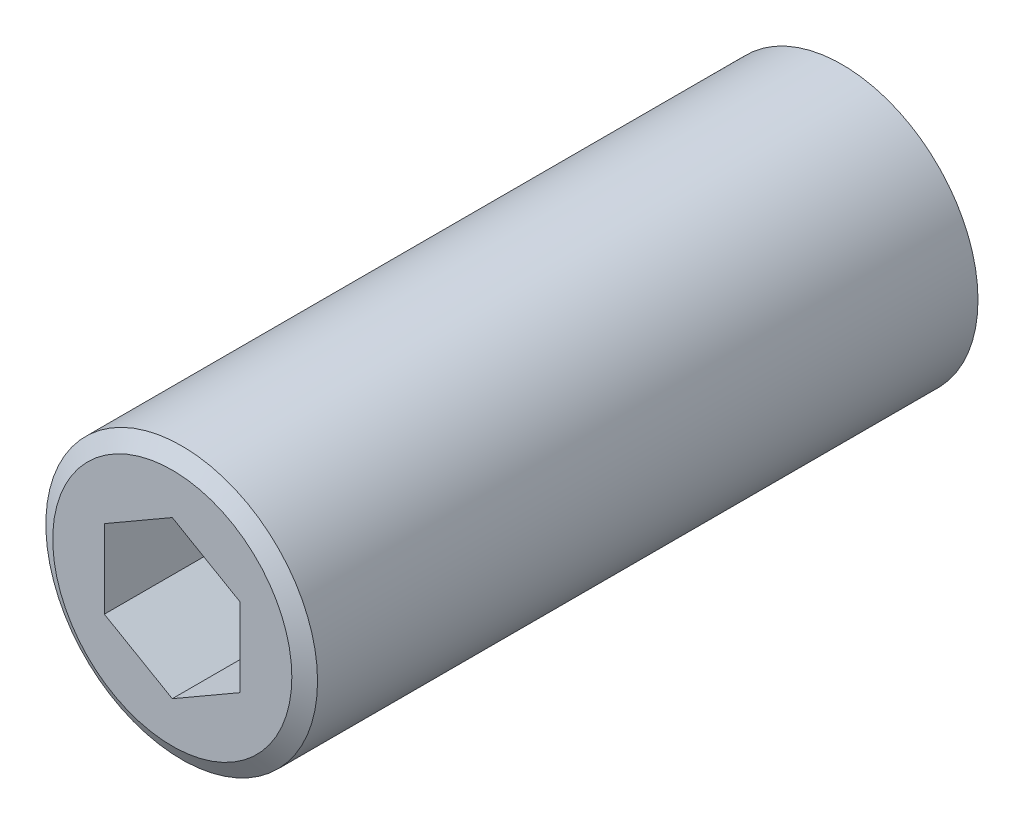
ISO-10303-21;
HEADER;
FILE_DESCRIPTION(('STEP AP214'),'2;1');
FILE_NAME('part.step','',(''),(''),'','','');
FILE_SCHEMA(('AUTOMOTIVE_DESIGN { 1 0 10303 214 1 1 1 1 }'));
ENDSEC;
DATA;
#1=APPLICATION_CONTEXT('core data for automotive mechanical design processes');
#2=APPLICATION_PROTOCOL_DEFINITION('international standard','automotive_design',2000,#1);
#3=PRODUCT_CONTEXT('',#1,'mechanical');
#4=PRODUCT('Part','Part','',(#3));
#5=PRODUCT_RELATED_PRODUCT_CATEGORY('part','',(#4));
#6=PRODUCT_DEFINITION_FORMATION('','',#4);
#7=PRODUCT_DEFINITION_CONTEXT('part definition',#1,'design');
#8=PRODUCT_DEFINITION('design','',#6,#7);
#9=PRODUCT_DEFINITION_SHAPE('','',#8);
#10=(LENGTH_UNIT() NAMED_UNIT(*) SI_UNIT(.MILLI.,.METRE.));
#11=(NAMED_UNIT(*) PLANE_ANGLE_UNIT() SI_UNIT($,.RADIAN.));
#12=(NAMED_UNIT(*) SI_UNIT($,.STERADIAN.) SOLID_ANGLE_UNIT());
#13=UNCERTAINTY_MEASURE_WITH_UNIT(LENGTH_MEASURE(1.E-05),#10,'distance_accuracy_value','');
#14=(GEOMETRIC_REPRESENTATION_CONTEXT(3) GLOBAL_UNCERTAINTY_ASSIGNED_CONTEXT((#13)) GLOBAL_UNIT_ASSIGNED_CONTEXT((#10,
#11,#12)) REPRESENTATION_CONTEXT('',''));
#15=CARTESIAN_POINT('',(0.,0.,0.));
#16=DIRECTION('',(0.,0.,1.));
#17=DIRECTION('',(1.,0.,0.));
#18=AXIS2_PLACEMENT_3D('',#15,#16,#17);
#19=CARTESIAN_POINT('',(10.,0.,1.27));
#20=DIRECTION('',(0.,0.,-1.));
#21=DIRECTION('',(-1.,0.,0.));
#22=AXIS2_PLACEMENT_3D('',#19,#20,#21);
#23=PLANE('',#22);
#24=CARTESIAN_POINT('',(0.,0.,1.27));
#25=DIRECTION('',(0.,0.,-1.));
#26=DIRECTION('',(-1.,0.,0.));
#27=AXIS2_PLACEMENT_3D('',#24,#25,#26);
#28=CIRCLE('',#27,8.8);
#29=CARTESIAN_POINT('',(-8.8,0.,1.27));
#30=VERTEX_POINT('',#29);
#31=EDGE_CURVE('E238',#30,#30,#28,.T.);
#32=ORIENTED_EDGE('',*,*,#31,.T.);
#33=EDGE_LOOP('',(#32));
#34=FACE_BOUND('',#33,.T.);
#35=CARTESIAN_POINT('',(0.,0.,1.27));
#36=DIRECTION('',(0.,0.,-1.));
#37=DIRECTION('',(-1.,0.,0.));
#38=AXIS2_PLACEMENT_3D('',#35,#36,#37);
#39=CIRCLE('',#38,6.35);
#40=CARTESIAN_POINT('',(-6.35,0.,1.27));
#41=VERTEX_POINT('',#40);
#42=EDGE_CURVE('E153',#41,#41,#39,.T.);
#43=ORIENTED_EDGE('',*,*,#42,.F.);
#44=EDGE_LOOP('',(#43));
#45=FACE_BOUND('',#44,.T.);
#46=ADVANCED_FACE('F14',(#34,#45),#23,.T.);
#47=CARTESIAN_POINT('',(0.,0.,46.27));
#48=DIRECTION('',(0.,0.,1.));
#49=DIRECTION('',(1.,0.,0.));
#50=AXIS2_PLACEMENT_3D('',#47,#48,#49);
#51=CYLINDRICAL_SURFACE('',#50,10.);
#52=CARTESIAN_POINT('',(0.,0.,50.5771796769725));
#53=DIRECTION('',(0.,0.,1.));
#54=DIRECTION('',(1.,0.,0.));
#55=AXIS2_PLACEMENT_3D('',#52,#53,#54);
#56=CIRCLE('',#55,10.);
#57=CARTESIAN_POINT('',(10.,0.,50.5771796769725));
#58=VERTEX_POINT('',#57);
#59=EDGE_CURVE('E9',#58,#58,#56,.F.);
#60=ORIENTED_EDGE('',*,*,#59,.T.);
#61=EDGE_LOOP('',(#60));
#62=FACE_BOUND('',#61,.T.);
#63=CARTESIAN_POINT('',(0.,0.,1.9628203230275));
#64=DIRECTION('',(0.,0.,-1.));
#65=DIRECTION('',(-1.,0.,0.));
#66=AXIS2_PLACEMENT_3D('',#63,#64,#65);
#67=CIRCLE('',#66,10.);
#68=CARTESIAN_POINT('',(-10.,0.,1.9628203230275));
#69=VERTEX_POINT('',#68);
#70=EDGE_CURVE('E235',#69,#69,#67,.F.);
#71=ORIENTED_EDGE('',*,*,#70,.T.);
#72=EDGE_LOOP('',(#71));
#73=FACE_BOUND('',#72,.T.);
#74=ADVANCED_FACE('F255',(#62,#73),#51,.T.);
#75=CARTESIAN_POINT('',(0.,0.,13.97));
#76=DIRECTION('',(0.,0.,-1.));
#77=DIRECTION('',(-1.,0.,0.));
#78=AXIS2_PLACEMENT_3D('',#75,#76,#77);
#79=CYLINDRICAL_SURFACE('',#78,6.35);
#80=ORIENTED_EDGE('',*,*,#42,.T.);
#81=EDGE_LOOP('',(#80));
#82=FACE_BOUND('',#81,.T.);
#83=CARTESIAN_POINT('',(0.,0.,1.5));
#84=DIRECTION('',(0.,0.,1.));
#85=DIRECTION('',(1.,0.,0.));
#86=AXIS2_PLACEMENT_3D('',#83,#84,#85);
#87=CIRCLE('',#86,6.35);
#88=CARTESIAN_POINT('',(6.35,0.,1.5));
#89=VERTEX_POINT('',#88);
#90=EDGE_CURVE('E163',#89,#89,#87,.T.);
#91=ORIENTED_EDGE('',*,*,#90,.T.);
#92=EDGE_LOOP('',(#91));
#93=FACE_BOUND('',#92,.T.);
#94=ADVANCED_FACE('F261',(#82,#93),#79,.F.);
#95=CARTESIAN_POINT('',(6.35,0.,1.5));
#96=DIRECTION('',(0.,-0.707106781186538,0.707106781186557));
#97=DIRECTION('',(0.,0.707106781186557,0.707106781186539));
#98=AXIS2_PLACEMENT_3D('',#95,#96,#97);
#99=PLANE('',#98);
#100=DIRECTION('',(-1.,0.,0.));
#101=VECTOR('',#100,1.);
#102=CARTESIAN_POINT('',(6.35,0.,1.5));
#103=LINE('',#102,#101);
#104=CARTESIAN_POINT('',(0.,0.,1.5));
#105=VERTEX_POINT('',#104);
#106=CARTESIAN_POINT('',(-3.,0.,1.5));
#107=VERTEX_POINT('',#106);
#108=EDGE_CURVE('E167',#105,#107,#103,.T.);
#109=ORIENTED_EDGE('',*,*,#108,.F.);
#110=DIRECTION('',(0.577350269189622,0.577350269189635,0.57735026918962));
#111=VECTOR('',#110,1.);
#112=CARTESIAN_POINT('',(-2.11666666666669,-2.11666666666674,-0.616666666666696));
#113=LINE('',#112,#111);
#114=CARTESIAN_POINT('',(-1.5,-1.5,0.));
#115=VERTEX_POINT('',#114);
#116=EDGE_CURVE('E197',#115,#105,#113,.T.);
#117=ORIENTED_EDGE('',*,*,#116,.F.);
#118=DIRECTION('',(0.577350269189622,-0.577350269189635,-0.57735026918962));
#119=VECTOR('',#118,1.);
#120=CARTESIAN_POINT('',(0.116666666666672,-3.11666666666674,-1.6166666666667));
#121=LINE('',#120,#119);
#122=EDGE_CURVE('E200',#107,#115,#121,.T.);
#123=ORIENTED_EDGE('',*,*,#122,.F.);
#124=EDGE_LOOP('',(#109,#117,#123));
#125=FACE_BOUND('',#124,.T.);
#126=ADVANCED_FACE('F324',(#125),#99,.F.);
#127=CARTESIAN_POINT('',(6.35,1.49999999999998,0.));
#128=DIRECTION('',(0.,0.707106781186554,0.707106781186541));
#129=DIRECTION('',(0.,0.707106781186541,-0.707106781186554));
#130=AXIS2_PLACEMENT_3D('',#127,#128,#129);
#131=PLANE('',#130);
#132=DIRECTION('',(-0.577350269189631,0.577350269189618,-0.577350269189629));
#133=VECTOR('',#132,1.);
#134=CARTESIAN_POINT('',(2.11666666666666,-2.11666666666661,3.6166666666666));
#135=LINE('',#134,#133);
#136=CARTESIAN_POINT('',(-1.49999999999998,1.49999999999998,0.));
#137=VERTEX_POINT('',#136);
#138=EDGE_CURVE('E205',#105,#137,#135,.T.);
#139=ORIENTED_EDGE('',*,*,#138,.F.);
#140=ORIENTED_EDGE('',*,*,#108,.T.);
#141=DIRECTION('',(-0.577350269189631,-0.577350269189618,0.577350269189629));
#142=VECTOR('',#141,1.);
#143=CARTESIAN_POINT('',(-4.11666666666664,-1.11666666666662,2.61666666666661));
#144=LINE('',#143,#142);
#145=EDGE_CURVE('E208',#137,#107,#144,.T.);
#146=ORIENTED_EDGE('',*,*,#145,.F.);
#147=EDGE_LOOP('',(#139,#140,#146));
#148=FACE_BOUND('',#147,.T.);
#149=ADVANCED_FACE('F311',(#148),#131,.F.);
#150=CARTESIAN_POINT('',(0.,-6.35,1.5));
#151=DIRECTION('',(-0.707106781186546,0.,0.707106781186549));
#152=DIRECTION('',(0.707106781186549,0.,0.707106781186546));
#153=AXIS2_PLACEMENT_3D('',#150,#151,#152);
#154=PLANE('',#153);
#155=DIRECTION('',(0.,1.,0.));
#156=VECTOR('',#155,1.);
#157=CARTESIAN_POINT('',(0.,-6.35,1.5));
#158=LINE('',#157,#156);
#159=CARTESIAN_POINT('',(0.,3.00000000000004,1.5));
#160=VERTEX_POINT('',#159);
#161=EDGE_CURVE('E212',#105,#160,#158,.T.);
#162=ORIENTED_EDGE('',*,*,#161,.F.);
#163=ORIENTED_EDGE('',*,*,#138,.T.);
#164=DIRECTION('',(0.577350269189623,0.577350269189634,0.577350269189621));
#165=VECTOR('',#164,1.);
#166=CARTESIAN_POINT('',(-3.1166666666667,-0.116666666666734,-1.6166666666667));
#167=LINE('',#166,#165);
#168=EDGE_CURVE('E179',#137,#160,#167,.T.);
#169=ORIENTED_EDGE('',*,*,#168,.T.);
#170=EDGE_LOOP('',(#162,#163,#169));
#171=FACE_BOUND('',#170,.T.);
#172=ADVANCED_FACE('F302',(#171),#154,.F.);
#173=CARTESIAN_POINT('',(1.5,-6.35,0.));
#174=DIRECTION('',(0.707106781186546,0.,0.707106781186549));
#175=DIRECTION('',(0.707106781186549,0.,-0.707106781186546));
#176=AXIS2_PLACEMENT_3D('',#173,#174,#175);
#177=PLANE('',#176);
#178=DIRECTION('',(0.577350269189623,-0.577350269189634,-0.577350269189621));
#179=VECTOR('',#178,1.);
#180=CARTESIAN_POINT('',(4.11666666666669,-1.11666666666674,-2.6166666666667));
#181=LINE('',#180,#179);
#182=CARTESIAN_POINT('',(1.49999999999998,1.49999999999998,0.));
#183=VERTEX_POINT('',#182);
#184=EDGE_CURVE('E176',#160,#183,#181,.T.);
#185=ORIENTED_EDGE('',*,*,#184,.T.);
#186=DIRECTION('',(-0.577350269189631,-0.577350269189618,0.577350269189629));
#187=VECTOR('',#186,1.);
#188=CARTESIAN_POINT('',(-1.11666666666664,-1.11666666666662,2.61666666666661));
#189=LINE('',#188,#187);
#190=EDGE_CURVE('E202',#183,#105,#189,.T.);
#191=ORIENTED_EDGE('',*,*,#190,.T.);
#192=ORIENTED_EDGE('',*,*,#161,.T.);
#193=EDGE_LOOP('',(#185,#191,#192));
#194=FACE_BOUND('',#193,.T.);
#195=ADVANCED_FACE('F299',(#194),#177,.F.);
#196=DIRECTION('',(-0.577350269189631,0.577350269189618,-0.577350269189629));
#197=VECTOR('',#196,1.);
#198=CARTESIAN_POINT('',(4.11666666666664,-1.11666666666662,2.61666666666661));
#199=LINE('',#198,#197);
#200=CARTESIAN_POINT('',(3.,0.,1.5));
#201=VERTEX_POINT('',#200);
#202=EDGE_CURVE('E226',#201,#183,#199,.T.);
#203=ORIENTED_EDGE('',*,*,#202,.F.);
#204=EDGE_CURVE('E37',#201,#105,#103,.T.);
#205=ORIENTED_EDGE('',*,*,#204,.T.);
#206=ORIENTED_EDGE('',*,*,#190,.F.);
#207=EDGE_LOOP('',(#203,#205,#206));
#208=FACE_BOUND('',#207,.T.);
#209=ADVANCED_FACE('F301',(#208),#131,.F.);
#210=ORIENTED_EDGE('',*,*,#204,.F.);
#211=DIRECTION('',(0.577350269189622,0.577350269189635,0.57735026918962));
#212=VECTOR('',#211,1.);
#213=CARTESIAN_POINT('',(-0.116666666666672,-3.11666666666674,-1.6166666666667));
#214=LINE('',#213,#212);
#215=CARTESIAN_POINT('',(1.5,-1.5,0.));
#216=VERTEX_POINT('',#215);
#217=EDGE_CURVE('E229',#216,#201,#214,.T.);
#218=ORIENTED_EDGE('',*,*,#217,.F.);
#219=DIRECTION('',(0.577350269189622,-0.577350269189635,-0.57735026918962));
#220=VECTOR('',#219,1.);
#221=CARTESIAN_POINT('',(3.11666666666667,-3.11666666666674,-1.6166666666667));
#222=LINE('',#221,#220);
#223=EDGE_CURVE('E194',#105,#216,#222,.T.);
#224=ORIENTED_EDGE('',*,*,#223,.F.);
#225=EDGE_LOOP('',(#210,#218,#224));
#226=FACE_BOUND('',#225,.T.);
#227=ADVANCED_FACE('F309',(#226),#99,.F.);
#228=ORIENTED_EDGE('',*,*,#223,.T.);
#229=DIRECTION('',(-0.57735026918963,-0.577350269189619,0.577350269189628));
#230=VECTOR('',#229,1.);
#231=CARTESIAN_POINT('',(-0.116666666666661,-3.11666666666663,1.6166666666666));
#232=LINE('',#231,#230);
#233=CARTESIAN_POINT('',(0.,-3.,1.5));
#234=VERTEX_POINT('',#233);
#235=EDGE_CURVE('E185',#216,#234,#232,.T.);
#236=ORIENTED_EDGE('',*,*,#235,.T.);
#237=EDGE_CURVE('E215',#234,#105,#158,.T.);
#238=ORIENTED_EDGE('',*,*,#237,.T.);
#239=EDGE_LOOP('',(#228,#236,#238));
#240=FACE_BOUND('',#239,.T.);
#241=ADVANCED_FACE('F304',(#240),#177,.F.);
#242=ORIENTED_EDGE('',*,*,#237,.F.);
#243=DIRECTION('',(-0.57735026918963,0.577350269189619,-0.577350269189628));
#244=VECTOR('',#243,1.);
#245=CARTESIAN_POINT('',(1.11666666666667,-4.11666666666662,2.61666666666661));
#246=LINE('',#245,#244);
#247=EDGE_CURVE('E188',#234,#115,#246,.T.);
#248=ORIENTED_EDGE('',*,*,#247,.T.);
#249=ORIENTED_EDGE('',*,*,#116,.T.);
#250=EDGE_LOOP('',(#242,#248,#249));
#251=FACE_BOUND('',#250,.T.);
#252=ADVANCED_FACE('F313',(#251),#154,.F.);
#253=CARTESIAN_POINT('',(-1.5,-6.35,0.));
#254=DIRECTION('',(0.707106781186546,0.,0.707106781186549));
#255=DIRECTION('',(0.707106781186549,0.,-0.707106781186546));
#256=AXIS2_PLACEMENT_3D('',#253,#254,#255);
#257=PLANE('',#256);
#258=ORIENTED_EDGE('',*,*,#122,.T.);
#259=DIRECTION('',(-0.577350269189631,-0.577350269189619,0.577350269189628));
#260=VECTOR('',#259,1.);
#261=CARTESIAN_POINT('',(-3.11666666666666,-3.11666666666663,1.6166666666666));
#262=LINE('',#261,#260);
#263=CARTESIAN_POINT('',(-3.,-3.,1.5));
#264=VERTEX_POINT('',#263);
#265=EDGE_CURVE('E191',#115,#264,#262,.T.);
#266=ORIENTED_EDGE('',*,*,#265,.T.);
#267=DIRECTION('',(0.,1.,0.));
#268=VECTOR('',#267,1.);
#269=CARTESIAN_POINT('',(-3.,-6.35,1.5));
#270=LINE('',#269,#268);
#271=EDGE_CURVE('E216',#264,#107,#270,.T.);
#272=ORIENTED_EDGE('',*,*,#271,.T.);
#273=EDGE_LOOP('',(#258,#266,#272));
#274=FACE_BOUND('',#273,.T.);
#275=ADVANCED_FACE('F320',(#274),#257,.F.);
#276=DIRECTION('',(0.577350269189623,-0.577350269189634,-0.577350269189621));
#277=VECTOR('',#276,1.);
#278=CARTESIAN_POINT('',(1.11666666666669,-1.11666666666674,-2.6166666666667));
#279=LINE('',#278,#277);
#280=CARTESIAN_POINT('',(-3.,3.,1.5));
#281=VERTEX_POINT('',#280);
#282=EDGE_CURVE('E182',#281,#137,#279,.T.);
#283=ORIENTED_EDGE('',*,*,#282,.T.);
#284=ORIENTED_EDGE('',*,*,#145,.T.);
#285=EDGE_CURVE('E217',#107,#281,#270,.T.);
#286=ORIENTED_EDGE('',*,*,#285,.T.);
#287=EDGE_LOOP('',(#283,#284,#286));
#288=FACE_BOUND('',#287,.T.);
#289=ADVANCED_FACE('F292',(#288),#257,.F.);
#290=CARTESIAN_POINT('',(6.35,1.49999999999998,0.));
#291=DIRECTION('',(0.,-0.707106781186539,0.707106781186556));
#292=DIRECTION('',(0.,0.707106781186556,0.707106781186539));
#293=AXIS2_PLACEMENT_3D('',#290,#291,#292);
#294=PLANE('',#293);
#295=DIRECTION('',(-1.,0.,0.));
#296=VECTOR('',#295,1.);
#297=CARTESIAN_POINT('',(6.35,3.,1.5));
#298=LINE('',#297,#296);
#299=EDGE_CURVE('E166',#160,#281,#298,.T.);
#300=ORIENTED_EDGE('',*,*,#299,.F.);
#301=ORIENTED_EDGE('',*,*,#168,.F.);
#302=ORIENTED_EDGE('',*,*,#282,.F.);
#303=EDGE_LOOP('',(#300,#301,#302));
#304=FACE_BOUND('',#303,.T.);
#305=ADVANCED_FACE('F339',(#304),#294,.F.);
#306=CARTESIAN_POINT('',(3.,3.,1.5));
#307=VERTEX_POINT('',#306);
#308=EDGE_CURVE('E173',#307,#160,#298,.T.);
#309=ORIENTED_EDGE('',*,*,#308,.F.);
#310=DIRECTION('',(0.577350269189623,0.577350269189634,0.577350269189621));
#311=VECTOR('',#310,1.);
#312=CARTESIAN_POINT('',(-1.11666666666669,-1.11666666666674,-2.6166666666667));
#313=LINE('',#312,#311);
#314=EDGE_CURVE('E223',#183,#307,#313,.T.);
#315=ORIENTED_EDGE('',*,*,#314,.F.);
#316=ORIENTED_EDGE('',*,*,#184,.F.);
#317=EDGE_LOOP('',(#309,#315,#316));
#318=FACE_BOUND('',#317,.T.);
#319=ADVANCED_FACE('F297',(#318),#294,.F.);
#320=CARTESIAN_POINT('',(1.5,-6.35,0.));
#321=DIRECTION('',(-0.707106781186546,0.,0.707106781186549));
#322=DIRECTION('',(0.707106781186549,0.,0.707106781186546));
#323=AXIS2_PLACEMENT_3D('',#320,#321,#322);
#324=PLANE('',#323);
#325=DIRECTION('',(0.,1.,0.));
#326=VECTOR('',#325,1.);
#327=CARTESIAN_POINT('',(3.,-6.35,1.5));
#328=LINE('',#327,#326);
#329=EDGE_CURVE('E211',#201,#307,#328,.T.);
#330=ORIENTED_EDGE('',*,*,#329,.F.);
#331=ORIENTED_EDGE('',*,*,#202,.T.);
#332=ORIENTED_EDGE('',*,*,#314,.T.);
#333=EDGE_LOOP('',(#330,#331,#332));
#334=FACE_BOUND('',#333,.T.);
#335=ADVANCED_FACE('F294',(#334),#324,.F.);
#336=CARTESIAN_POINT('',(3.00000000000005,-3.,1.5));
#337=VERTEX_POINT('',#336);
#338=EDGE_CURVE('E220',#337,#201,#328,.T.);
#339=ORIENTED_EDGE('',*,*,#338,.F.);
#340=DIRECTION('',(-0.57735026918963,0.577350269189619,-0.577350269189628));
#341=VECTOR('',#340,1.);
#342=CARTESIAN_POINT('',(3.11666666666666,-3.11666666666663,1.6166666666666));
#343=LINE('',#342,#341);
#344=EDGE_CURVE('E232',#337,#216,#343,.T.);
#345=ORIENTED_EDGE('',*,*,#344,.T.);
#346=ORIENTED_EDGE('',*,*,#217,.T.);
#347=EDGE_LOOP('',(#339,#345,#346));
#348=FACE_BOUND('',#347,.T.);
#349=ADVANCED_FACE('F296',(#348),#324,.F.);
#350=CARTESIAN_POINT('',(6.35,-1.5,0.));
#351=DIRECTION('',(0.,0.707106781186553,0.707106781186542));
#352=DIRECTION('',(0.,0.707106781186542,-0.707106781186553));
#353=AXIS2_PLACEMENT_3D('',#350,#351,#352);
#354=PLANE('',#353);
#355=ORIENTED_EDGE('',*,*,#344,.F.);
#356=DIRECTION('',(-1.,0.,0.));
#357=VECTOR('',#356,1.);
#358=CARTESIAN_POINT('',(6.35,-3.,1.5));
#359=LINE('',#358,#357);
#360=EDGE_CURVE('E170',#337,#234,#359,.T.);
#361=ORIENTED_EDGE('',*,*,#360,.T.);
#362=ORIENTED_EDGE('',*,*,#235,.F.);
#363=EDGE_LOOP('',(#355,#361,#362));
#364=FACE_BOUND('',#363,.T.);
#365=ADVANCED_FACE('F285',(#364),#354,.F.);
#366=ORIENTED_EDGE('',*,*,#247,.F.);
#367=EDGE_CURVE('E171',#234,#264,#359,.T.);
#368=ORIENTED_EDGE('',*,*,#367,.T.);
#369=ORIENTED_EDGE('',*,*,#265,.F.);
#370=EDGE_LOOP('',(#366,#368,#369));
#371=FACE_BOUND('',#370,.T.);
#372=ADVANCED_FACE('F275',(#371),#354,.F.);
#373=CARTESIAN_POINT('',(-3.,-6.35,1.5));
#374=DIRECTION('',(0.,0.,1.));
#375=DIRECTION('',(1.,0.,0.));
#376=AXIS2_PLACEMENT_3D('',#373,#374,#375);
#377=PLANE('',#376);
#378=ORIENTED_EDGE('',*,*,#367,.F.);
#379=ORIENTED_EDGE('',*,*,#360,.F.);
#380=ORIENTED_EDGE('',*,*,#338,.T.);
#381=ORIENTED_EDGE('',*,*,#329,.T.);
#382=ORIENTED_EDGE('',*,*,#308,.T.);
#383=ORIENTED_EDGE('',*,*,#299,.T.);
#384=ORIENTED_EDGE('',*,*,#285,.F.);
#385=ORIENTED_EDGE('',*,*,#271,.F.);
#386=EDGE_LOOP('',(#378,#379,#380,#381,#382,#383,#384,#385));
#387=FACE_BOUND('',#386,.T.);
#388=ORIENTED_EDGE('',*,*,#90,.F.);
#389=EDGE_LOOP('',(#388));
#390=FACE_BOUND('',#389,.T.);
#391=ADVANCED_FACE('F268',(#387,#390),#377,.F.);
#392=CARTESIAN_POINT('',(0.,0.,1.9628203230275));
#393=DIRECTION('',(0.,0.,1.));
#394=DIRECTION('',(1.,0.,0.));
#395=AXIS2_PLACEMENT_3D('',#392,#393,#394);
#396=CONICAL_SURFACE('',#395,10.,1.0471975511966);
#397=ORIENTED_EDGE('',*,*,#31,.F.);
#398=EDGE_LOOP('',(#397));
#399=FACE_BOUND('',#398,.T.);
#400=ORIENTED_EDGE('',*,*,#70,.F.);
#401=EDGE_LOOP('',(#400));
#402=FACE_BOUND('',#401,.T.);
#403=ADVANCED_FACE('F266',(#399,#402),#396,.T.);
#404=CARTESIAN_POINT('',(0.,0.,51.27));
#405=DIRECTION('',(0.,0.,1.));
#406=DIRECTION('',(1.,0.,0.));
#407=AXIS2_PLACEMENT_3D('',#404,#405,#406);
#408=PLANE('',#407);
#409=CARTESIAN_POINT('',(0.,0.,51.27));
#410=DIRECTION('',(0.,0.,1.));
#411=DIRECTION('',(1.,0.,0.));
#412=AXIS2_PLACEMENT_3D('',#409,#410,#411);
#413=CIRCLE('',#412,8.8);
#414=CARTESIAN_POINT('',(8.8,0.,51.27));
#415=VERTEX_POINT('',#414);
#416=EDGE_CURVE('E22',#415,#415,#413,.T.);
#417=ORIENTED_EDGE('',*,*,#416,.T.);
#418=EDGE_LOOP('',(#417));
#419=FACE_BOUND('',#418,.T.);
#420=DIRECTION('',(-0.866025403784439,0.5,0.));
#421=VECTOR('',#420,1.);
#422=CARTESIAN_POINT('',(5.,2.88675134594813,51.27));
#423=LINE('',#422,#421);
#424=CARTESIAN_POINT('',(5.,2.88675134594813,51.27));
#425=VERTEX_POINT('',#424);
#426=CARTESIAN_POINT('',(0.,5.77350269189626,51.27));
#427=VERTEX_POINT('',#426);
#428=EDGE_CURVE('E29',#425,#427,#423,.T.);
#429=ORIENTED_EDGE('',*,*,#428,.F.);
#430=DIRECTION('',(0.,1.,0.));
#431=VECTOR('',#430,1.);
#432=CARTESIAN_POINT('',(5.,-2.88675134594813,51.27));
#433=LINE('',#432,#431);
#434=CARTESIAN_POINT('',(5.,-2.88675134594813,51.27));
#435=VERTEX_POINT('',#434);
#436=EDGE_CURVE('E127',#435,#425,#433,.T.);
#437=ORIENTED_EDGE('',*,*,#436,.F.);
#438=DIRECTION('',(0.866025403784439,0.5,0.));
#439=VECTOR('',#438,1.);
#440=CARTESIAN_POINT('',(0.,-5.77350269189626,51.27));
#441=LINE('',#440,#439);
#442=CARTESIAN_POINT('',(0.,-5.77350269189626,51.27));
#443=VERTEX_POINT('',#442);
#444=EDGE_CURVE('E130',#443,#435,#441,.T.);
#445=ORIENTED_EDGE('',*,*,#444,.F.);
#446=DIRECTION('',(0.866025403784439,-0.5,0.));
#447=VECTOR('',#446,1.);
#448=CARTESIAN_POINT('',(-5.,-2.88675134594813,51.27));
#449=LINE('',#448,#447);
#450=CARTESIAN_POINT('',(-5.,-2.88675134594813,51.27));
#451=VERTEX_POINT('',#450);
#452=EDGE_CURVE('E146',#451,#443,#449,.T.);
#453=ORIENTED_EDGE('',*,*,#452,.F.);
#454=DIRECTION('',(0.,-1.,0.));
#455=VECTOR('',#454,1.);
#456=CARTESIAN_POINT('',(-5.,2.88675134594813,51.27));
#457=LINE('',#456,#455);
#458=CARTESIAN_POINT('',(-5.,2.88675134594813,51.27));
#459=VERTEX_POINT('',#458);
#460=EDGE_CURVE('E143',#459,#451,#457,.T.);
#461=ORIENTED_EDGE('',*,*,#460,.F.);
#462=DIRECTION('',(-0.866025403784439,-0.5,0.));
#463=VECTOR('',#462,1.);
#464=CARTESIAN_POINT('',(0.,5.77350269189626,51.27));
#465=LINE('',#464,#463);
#466=EDGE_CURVE('E141',#427,#459,#465,.T.);
#467=ORIENTED_EDGE('',*,*,#466,.F.);
#468=EDGE_LOOP('',(#429,#437,#445,#453,#461,#467));
#469=FACE_BOUND('',#468,.T.);
#470=ADVANCED_FACE('F243',(#419,#469),#408,.T.);
#471=CARTESIAN_POINT('',(5.,2.88675134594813,43.27));
#472=DIRECTION('',(0.5,0.866025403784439,0.));
#473=DIRECTION('',(0.866025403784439,-0.5,0.));
#474=AXIS2_PLACEMENT_3D('',#471,#472,#473);
#475=PLANE('',#474);
#476=ORIENTED_EDGE('',*,*,#428,.T.);
#477=DIRECTION('',(0.,0.,1.));
#478=VECTOR('',#477,1.);
#479=CARTESIAN_POINT('',(0.,5.77350269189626,43.27));
#480=LINE('',#479,#478);
#481=CARTESIAN_POINT('',(0.,5.77350269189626,43.27));
#482=VERTEX_POINT('',#481);
#483=EDGE_CURVE('E104',#482,#427,#480,.T.);
#484=ORIENTED_EDGE('',*,*,#483,.F.);
#485=DIRECTION('',(-0.866025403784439,0.5,0.));
#486=VECTOR('',#485,1.);
#487=CARTESIAN_POINT('',(5.,2.88675134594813,43.27));
#488=LINE('',#487,#486);
#489=CARTESIAN_POINT('',(5.,2.88675134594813,43.27));
#490=VERTEX_POINT('',#489);
#491=EDGE_CURVE('E108',#490,#482,#488,.T.);
#492=ORIENTED_EDGE('',*,*,#491,.F.);
#493=DIRECTION('',(0.,0.,1.));
#494=VECTOR('',#493,1.);
#495=CARTESIAN_POINT('',(5.,2.88675134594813,43.27));
#496=LINE('',#495,#494);
#497=EDGE_CURVE('E151',#490,#425,#496,.T.);
#498=ORIENTED_EDGE('',*,*,#497,.T.);
#499=EDGE_LOOP('',(#476,#484,#492,#498));
#500=FACE_BOUND('',#499,.T.);
#501=ADVANCED_FACE('F106',(#500),#475,.F.);
#502=CARTESIAN_POINT('',(5.,-2.88675134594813,43.27));
#503=DIRECTION('',(1.,0.,0.));
#504=DIRECTION('',(0.,0.,-1.));
#505=AXIS2_PLACEMENT_3D('',#502,#503,#504);
#506=PLANE('',#505);
#507=ORIENTED_EDGE('',*,*,#436,.T.);
#508=ORIENTED_EDGE('',*,*,#497,.F.);
#509=DIRECTION('',(0.,1.,0.));
#510=VECTOR('',#509,1.);
#511=CARTESIAN_POINT('',(5.,-2.88675134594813,43.27));
#512=LINE('',#511,#510);
#513=CARTESIAN_POINT('',(5.,-2.88675134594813,43.27));
#514=VERTEX_POINT('',#513);
#515=EDGE_CURVE('E114',#514,#490,#512,.T.);
#516=ORIENTED_EDGE('',*,*,#515,.F.);
#517=DIRECTION('',(0.,0.,1.));
#518=VECTOR('',#517,1.);
#519=CARTESIAN_POINT('',(5.,-2.88675134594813,43.27));
#520=LINE('',#519,#518);
#521=EDGE_CURVE('E154',#514,#435,#520,.T.);
#522=ORIENTED_EDGE('',*,*,#521,.T.);
#523=EDGE_LOOP('',(#507,#508,#516,#522));
#524=FACE_BOUND('',#523,.T.);
#525=ADVANCED_FACE('F370',(#524),#506,.F.);
#526=CARTESIAN_POINT('',(0.,-5.77350269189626,43.27));
#527=DIRECTION('',(0.5,-0.866025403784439,0.));
#528=DIRECTION('',(-0.866025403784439,-0.5,0.));
#529=AXIS2_PLACEMENT_3D('',#526,#527,#528);
#530=PLANE('',#529);
#531=ORIENTED_EDGE('',*,*,#444,.T.);
#532=ORIENTED_EDGE('',*,*,#521,.F.);
#533=DIRECTION('',(0.866025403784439,0.5,0.));
#534=VECTOR('',#533,1.);
#535=CARTESIAN_POINT('',(0.,-5.77350269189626,43.27));
#536=LINE('',#535,#534);
#537=CARTESIAN_POINT('',(0.,-5.77350269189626,43.27));
#538=VERTEX_POINT('',#537);
#539=EDGE_CURVE('E137',#538,#514,#536,.T.);
#540=ORIENTED_EDGE('',*,*,#539,.F.);
#541=DIRECTION('',(0.,0.,1.));
#542=VECTOR('',#541,1.);
#543=CARTESIAN_POINT('',(0.,-5.77350269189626,43.27));
#544=LINE('',#543,#542);
#545=EDGE_CURVE('E156',#538,#443,#544,.T.);
#546=ORIENTED_EDGE('',*,*,#545,.T.);
#547=EDGE_LOOP('',(#531,#532,#540,#546));
#548=FACE_BOUND('',#547,.T.);
#549=ADVANCED_FACE('F380',(#548),#530,.F.);
#550=CARTESIAN_POINT('',(-5.,-2.88675134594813,43.27));
#551=DIRECTION('',(-0.5,-0.866025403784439,0.));
#552=DIRECTION('',(-0.866025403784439,0.5,0.));
#553=AXIS2_PLACEMENT_3D('',#550,#551,#552);
#554=PLANE('',#553);
#555=ORIENTED_EDGE('',*,*,#452,.T.);
#556=ORIENTED_EDGE('',*,*,#545,.F.);
#557=DIRECTION('',(0.866025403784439,-0.5,0.));
#558=VECTOR('',#557,1.);
#559=CARTESIAN_POINT('',(-5.,-2.88675134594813,43.27));
#560=LINE('',#559,#558);
#561=CARTESIAN_POINT('',(-5.,-2.88675134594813,43.27));
#562=VERTEX_POINT('',#561);
#563=EDGE_CURVE('E134',#562,#538,#560,.T.);
#564=ORIENTED_EDGE('',*,*,#563,.F.);
#565=DIRECTION('',(0.,0.,1.));
#566=VECTOR('',#565,1.);
#567=CARTESIAN_POINT('',(-5.,-2.88675134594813,43.27));
#568=LINE('',#567,#566);
#569=EDGE_CURVE('E158',#562,#451,#568,.T.);
#570=ORIENTED_EDGE('',*,*,#569,.T.);
#571=EDGE_LOOP('',(#555,#556,#564,#570));
#572=FACE_BOUND('',#571,.T.);
#573=ADVANCED_FACE('F376',(#572),#554,.F.);
#574=CARTESIAN_POINT('',(-5.,2.88675134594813,43.27));
#575=DIRECTION('',(-1.,0.,0.));
#576=DIRECTION('',(0.,1.,0.));
#577=AXIS2_PLACEMENT_3D('',#574,#575,#576);
#578=PLANE('',#577);
#579=ORIENTED_EDGE('',*,*,#460,.T.);
#580=ORIENTED_EDGE('',*,*,#569,.F.);
#581=DIRECTION('',(0.,-1.,0.));
#582=VECTOR('',#581,1.);
#583=CARTESIAN_POINT('',(-5.,2.88675134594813,43.27));
#584=LINE('',#583,#582);
#585=CARTESIAN_POINT('',(-5.,2.88675134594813,43.27));
#586=VERTEX_POINT('',#585);
#587=EDGE_CURVE('E122',#586,#562,#584,.T.);
#588=ORIENTED_EDGE('',*,*,#587,.F.);
#589=DIRECTION('',(0.,0.,1.));
#590=VECTOR('',#589,1.);
#591=CARTESIAN_POINT('',(-5.,2.88675134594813,43.27));
#592=LINE('',#591,#590);
#593=EDGE_CURVE('E113',#586,#459,#592,.T.);
#594=ORIENTED_EDGE('',*,*,#593,.T.);
#595=EDGE_LOOP('',(#579,#580,#588,#594));
#596=FACE_BOUND('',#595,.T.);
#597=ADVANCED_FACE('F373',(#596),#578,.F.);
#598=CARTESIAN_POINT('',(0.,5.77350269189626,43.27));
#599=DIRECTION('',(-0.5,0.866025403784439,0.));
#600=DIRECTION('',(0.866025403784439,0.5,0.));
#601=AXIS2_PLACEMENT_3D('',#598,#599,#600);
#602=PLANE('',#601);
#603=ORIENTED_EDGE('',*,*,#466,.T.);
#604=ORIENTED_EDGE('',*,*,#593,.F.);
#605=DIRECTION('',(-0.866025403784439,-0.5,0.));
#606=VECTOR('',#605,1.);
#607=CARTESIAN_POINT('',(0.,5.77350269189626,43.27));
#608=LINE('',#607,#606);
#609=EDGE_CURVE('E117',#482,#586,#608,.T.);
#610=ORIENTED_EDGE('',*,*,#609,.F.);
#611=ORIENTED_EDGE('',*,*,#483,.T.);
#612=EDGE_LOOP('',(#603,#604,#610,#611));
#613=FACE_BOUND('',#612,.T.);
#614=ADVANCED_FACE('F118',(#613),#602,.F.);
#615=CARTESIAN_POINT('',(0.,5.77350269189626,43.27));
#616=DIRECTION('',(0.,0.,1.));
#617=DIRECTION('',(1.,0.,0.));
#618=AXIS2_PLACEMENT_3D('',#615,#616,#617);
#619=PLANE('',#618);
#620=ORIENTED_EDGE('',*,*,#491,.T.);
#621=ORIENTED_EDGE('',*,*,#609,.T.);
#622=ORIENTED_EDGE('',*,*,#587,.T.);
#623=ORIENTED_EDGE('',*,*,#563,.T.);
#624=ORIENTED_EDGE('',*,*,#539,.T.);
#625=ORIENTED_EDGE('',*,*,#515,.T.);
#626=EDGE_LOOP('',(#620,#621,#622,#623,#624,#625));
#627=FACE_BOUND('',#626,.T.);
#628=ADVANCED_FACE('F124',(#627),#619,.T.);
#629=CARTESIAN_POINT('',(0.,0.,51.27));
#630=DIRECTION('',(0.,0.,-1.));
#631=DIRECTION('',(-1.,0.,0.));
#632=AXIS2_PLACEMENT_3D('',#629,#630,#631);
#633=CONICAL_SURFACE('',#632,8.8,1.0471975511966);
#634=ORIENTED_EDGE('',*,*,#59,.F.);
#635=EDGE_LOOP('',(#634));
#636=FACE_BOUND('',#635,.T.);
#637=ORIENTED_EDGE('',*,*,#416,.F.);
#638=EDGE_LOOP('',(#637));
#639=FACE_BOUND('',#638,.T.);
#640=ADVANCED_FACE('F16',(#636,#639),#633,.T.);
#641=CLOSED_SHELL('',(#46,#74,#94,#126,#149,#172,#195,#209,#227,#241,#252,#275,#289,#305,#319,
#335,#349,#365,#372,#391,#403,#470,#501,#525,#549,#573,#597,#614,#628,#640));
#642=MANIFOLD_SOLID_BREP('B1',#641);
#643=ADVANCED_BREP_SHAPE_REPRESENTATION('',(#18,#642),#14);
#644=SHAPE_DEFINITION_REPRESENTATION(#9,#643);
ENDSEC;
END-ISO-10303-21;
